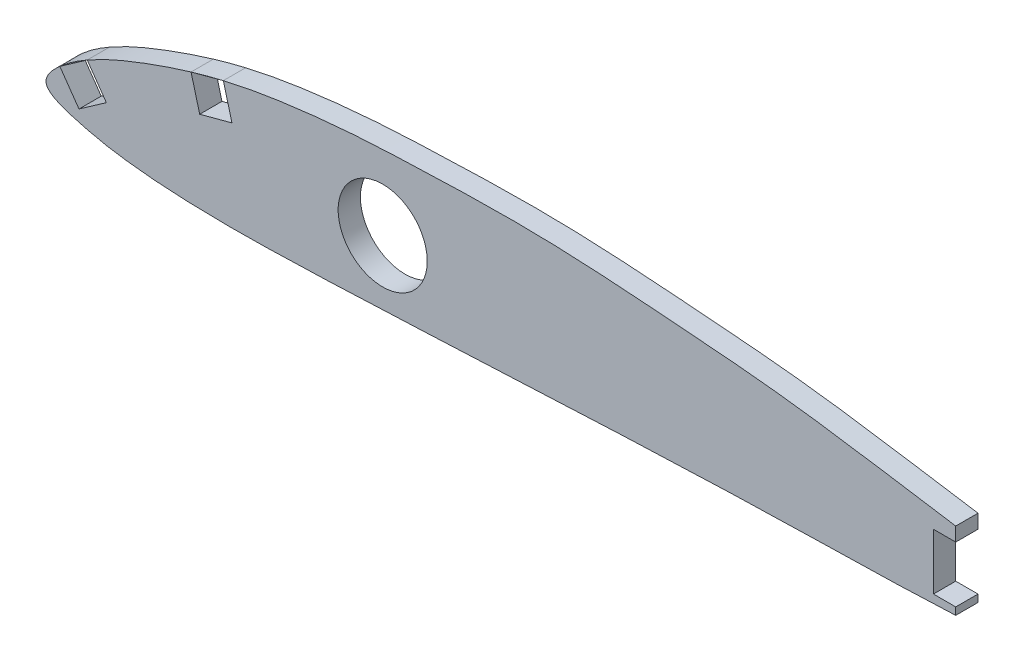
from build123d import *

# Parameters (mm, degrees)
BOSS_EXTRUDE1_DEPTH = 3.175
SKETCH1_R           = 6.35
CUT_EXTRUDE1_DEPTH  = 10


with BuildPart() as part:
    # 3DSketch1 → Boss-Extrude1 (new body)
    with BuildSketch(Plane(origin=(0, 0, 0), x_dir=(0.999981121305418, -0.006144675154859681, 0), z_dir=(0, 0, 1))):
        with BuildLine():
            add(Edge.make_bspline(
                [(0, 0), (-0.054270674, 0.941256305), (1.98873059, 3.067502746), (4.8960183, 5.176872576), (8.668212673, 7.2381647), (15.897969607, 10.230930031), (24.672831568, 13.090114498), (35.069962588, 14.818385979), (43.88539307, 15.752878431), (55.623770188, 16.317109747), (70.312732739, 16.824079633), (87.903988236, 15.698030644), (105.623093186, 14.426848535), (122.948887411, 11.760476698), (141.533943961, 9.036037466), (155.724549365, 5.789516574), (185.924881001, 0), (146.887799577, 1.134858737), (129.924714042, -0.52270007), (93.288930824, -1.325419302), (64.65767789, -3.062018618), (35.17728343, -4.52858489), (20.686823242, -4.855261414), (10.013718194, -3.887698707), (4.575802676, -2.679435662), (0.074473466, -1.291648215), (0, 0)],
                knots=[0, 0, 0, 0, 0.010560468, 0.018211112, 0.032209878, 0.045524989, 0.084069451, 0.108974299, 0.133649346, 0.158232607, 0.207343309, 0.256522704, 0.305826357, 0.355445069, 0.405214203, 0.45539047, 0.506006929, 0.555121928, 0.653369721, 0.702490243, 0.849938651, 0.899083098, 0.948194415, 0.97290595, 0.985508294, 1, 1, 1, 1], degree=3))
        make_face()
    extrude(amount=BOSS_EXTRUDE1_DEPTH)

    # Sketch1 → Cut-Extrude1 (cut)
    with BuildSketch(Plane.XY.offset(3.175)):
        with Locations((47.995, 5)):
            Circle(SKETCH1_R)
        Polygon((129.677, 0), (129.677, -7.226458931), (195.04979929, -7.226458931), (195.04979929, 23.632082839), (129.677, 23.632082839), (129.677, 8), (126.502, 8), (126.502, 0), align=None)
        Polygon((1.971526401, 2.879288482), (5.872738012, 5.61094626), (8.60439579, 1.709734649), (4.703184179, -1.021923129), align=None)
        Polygon((20.676835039, 11.533666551), (25.277056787, 12.766292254), (26.509682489, 8.166070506), (21.909460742, 6.933444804), align=None)
    extrude(amount=-CUT_EXTRUDE1_DEPTH, mode=Mode.SUBTRACT)


solid = part.part
